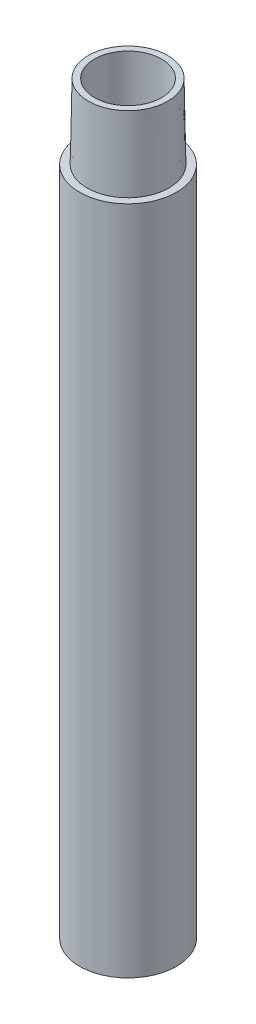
ISO-10303-21;
HEADER;
FILE_DESCRIPTION(('STEP AP214'),'2;1');
FILE_NAME('part.step','',(''),(''),'','','');
FILE_SCHEMA(('AUTOMOTIVE_DESIGN { 1 0 10303 214 1 1 1 1 }'));
ENDSEC;
DATA;
#1=APPLICATION_CONTEXT('core data for automotive mechanical design processes');
#2=APPLICATION_PROTOCOL_DEFINITION('international standard','automotive_design',2000,#1);
#3=PRODUCT_CONTEXT('',#1,'mechanical');
#4=PRODUCT('Part','Part','',(#3));
#5=PRODUCT_RELATED_PRODUCT_CATEGORY('part','',(#4));
#6=PRODUCT_DEFINITION_FORMATION('','',#4);
#7=PRODUCT_DEFINITION_CONTEXT('part definition',#1,'design');
#8=PRODUCT_DEFINITION('design','',#6,#7);
#9=PRODUCT_DEFINITION_SHAPE('','',#8);
#10=(LENGTH_UNIT() NAMED_UNIT(*) SI_UNIT(.MILLI.,.METRE.));
#11=(NAMED_UNIT(*) PLANE_ANGLE_UNIT() SI_UNIT($,.RADIAN.));
#12=(NAMED_UNIT(*) SI_UNIT($,.STERADIAN.) SOLID_ANGLE_UNIT());
#13=UNCERTAINTY_MEASURE_WITH_UNIT(LENGTH_MEASURE(1.E-05),#10,'distance_accuracy_value','');
#14=(GEOMETRIC_REPRESENTATION_CONTEXT(3) GLOBAL_UNCERTAINTY_ASSIGNED_CONTEXT((#13)) GLOBAL_UNIT_ASSIGNED_CONTEXT((#10,
#11,#12)) REPRESENTATION_CONTEXT('',''));
#15=CARTESIAN_POINT('',(0.,0.,0.));
#16=DIRECTION('',(0.,0.,1.));
#17=DIRECTION('',(1.,0.,0.));
#18=AXIS2_PLACEMENT_3D('',#15,#16,#17);
#19=CARTESIAN_POINT('',(55.,-919.506010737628,0.));
#20=DIRECTION('',(0.,-1.,0.));
#21=DIRECTION('',(0.,0.,-1.));
#22=AXIS2_PLACEMENT_3D('',#19,#20,#21);
#23=PLANE('',#22);
#24=CARTESIAN_POINT('',(0.,-919.506010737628,0.));
#25=DIRECTION('',(0.,-1.,0.));
#26=DIRECTION('',(0.,0.,-1.));
#27=AXIS2_PLACEMENT_3D('',#24,#25,#26);
#28=CIRCLE('',#27,65.);
#29=CARTESIAN_POINT('',(0.,-919.506010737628,-65.));
#30=VERTEX_POINT('',#29);
#31=EDGE_CURVE('E10',#30,#30,#28,.T.);
#32=ORIENTED_EDGE('',*,*,#31,.T.);
#33=EDGE_LOOP('',(#32));
#34=FACE_BOUND('',#33,.T.);
#35=CARTESIAN_POINT('',(0.,-919.506010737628,0.));
#36=DIRECTION('',(0.,-1.,0.));
#37=DIRECTION('',(0.,0.,-1.));
#38=AXIS2_PLACEMENT_3D('',#35,#36,#37);
#39=CIRCLE('',#38,55.);
#40=CARTESIAN_POINT('',(0.,-919.506010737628,-55.));
#41=VERTEX_POINT('',#40);
#42=EDGE_CURVE('E55',#41,#41,#39,.T.);
#43=ORIENTED_EDGE('',*,*,#42,.F.);
#44=EDGE_LOOP('',(#43));
#45=FACE_BOUND('',#44,.T.);
#46=ADVANCED_FACE('F29',(#34,#45),#23,.T.);
#47=CARTESIAN_POINT('',(0.,-969.506010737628,0.));
#48=DIRECTION('',(0.,-1.,0.));
#49=DIRECTION('',(0.,0.,-1.));
#50=AXIS2_PLACEMENT_3D('',#47,#48,#49);
#51=CYLINDRICAL_SURFACE('',#50,65.);
#52=CARTESIAN_POINT('',(0.,-19.5060107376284,0.));
#53=DIRECTION('',(0.,-1.,0.));
#54=DIRECTION('',(0.,0.,-1.));
#55=AXIS2_PLACEMENT_3D('',#52,#53,#54);
#56=CIRCLE('',#55,65.);
#57=CARTESIAN_POINT('',(0.,-19.5060107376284,-65.));
#58=VERTEX_POINT('',#57);
#59=EDGE_CURVE('E37',#58,#58,#56,.T.);
#60=ORIENTED_EDGE('',*,*,#59,.T.);
#61=EDGE_LOOP('',(#60));
#62=FACE_BOUND('',#61,.T.);
#63=ORIENTED_EDGE('',*,*,#31,.F.);
#64=EDGE_LOOP('',(#63));
#65=FACE_BOUND('',#64,.T.);
#66=ADVANCED_FACE('F63',(#62,#65),#51,.T.);
#67=CARTESIAN_POINT('',(65.,-19.5060107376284,0.));
#68=DIRECTION('',(0.,1.,0.));
#69=DIRECTION('',(0.,0.,1.));
#70=AXIS2_PLACEMENT_3D('',#67,#68,#69);
#71=PLANE('',#70);
#72=CARTESIAN_POINT('',(0.,-19.5060107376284,0.));
#73=DIRECTION('',(0.,-1.,0.));
#74=DIRECTION('',(0.,0.,-1.));
#75=AXIS2_PLACEMENT_3D('',#72,#73,#74);
#76=CIRCLE('',#75,55.);
#77=CARTESIAN_POINT('',(0.,-19.5060107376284,-55.));
#78=VERTEX_POINT('',#77);
#79=EDGE_CURVE('E41',#78,#78,#76,.T.);
#80=ORIENTED_EDGE('',*,*,#79,.T.);
#81=EDGE_LOOP('',(#80));
#82=FACE_BOUND('',#81,.T.);
#83=ORIENTED_EDGE('',*,*,#59,.F.);
#84=EDGE_LOOP('',(#83));
#85=FACE_BOUND('',#84,.T.);
#86=ADVANCED_FACE('F67',(#82,#85),#71,.T.);
#87=CARTESIAN_POINT('',(0.,-19.5060107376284,0.));
#88=DIRECTION('',(0.,-1.,0.));
#89=DIRECTION('',(0.,0.,-1.));
#90=AXIS2_PLACEMENT_3D('',#87,#88,#89);
#91=CONICAL_SURFACE('',#90,55.,0.0174532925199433);
#92=CARTESIAN_POINT('',(0.,80.4939892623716,0.));
#93=DIRECTION('',(0.,1.,0.));
#94=DIRECTION('',(0.,0.,1.));
#95=AXIS2_PLACEMENT_3D('',#92,#93,#94);
#96=CIRCLE('',#95,53.2544935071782);
#97=CARTESIAN_POINT('',(0.,80.4939892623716,53.2544935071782));
#98=VERTEX_POINT('',#97);
#99=EDGE_CURVE('E33',#98,#98,#96,.F.);
#100=ORIENTED_EDGE('',*,*,#99,.T.);
#101=EDGE_LOOP('',(#100));
#102=FACE_BOUND('',#101,.T.);
#103=ORIENTED_EDGE('',*,*,#79,.F.);
#104=EDGE_LOOP('',(#103));
#105=FACE_BOUND('',#104,.T.);
#106=ADVANCED_FACE('F31',(#102,#105),#91,.T.);
#107=CARTESIAN_POINT('',(55.,80.4939892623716,0.));
#108=DIRECTION('',(0.,1.,0.));
#109=DIRECTION('',(0.,0.,1.));
#110=AXIS2_PLACEMENT_3D('',#107,#108,#109);
#111=PLANE('',#110);
#112=CARTESIAN_POINT('',(0.,80.4939892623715,0.));
#113=DIRECTION('',(0.,-1.,0.));
#114=DIRECTION('',(0.,0.,-1.));
#115=AXIS2_PLACEMENT_3D('',#112,#113,#114);
#116=CIRCLE('',#115,45.);
#117=CARTESIAN_POINT('',(0.,80.4939892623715,-45.));
#118=VERTEX_POINT('',#117);
#119=EDGE_CURVE('E46',#118,#118,#116,.T.);
#120=ORIENTED_EDGE('',*,*,#119,.T.);
#121=EDGE_LOOP('',(#120));
#122=FACE_BOUND('',#121,.T.);
#123=ORIENTED_EDGE('',*,*,#99,.F.);
#124=EDGE_LOOP('',(#123));
#125=FACE_BOUND('',#124,.T.);
#126=ADVANCED_FACE('F74',(#122,#125),#111,.T.);
#127=CARTESIAN_POINT('',(0.,-969.506010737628,0.));
#128=DIRECTION('',(0.,-1.,0.));
#129=DIRECTION('',(0.,0.,-1.));
#130=AXIS2_PLACEMENT_3D('',#127,#128,#129);
#131=CYLINDRICAL_SURFACE('',#130,45.);
#132=CARTESIAN_POINT('',(0.,-29.5060107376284,0.));
#133=DIRECTION('',(0.,-1.,0.));
#134=DIRECTION('',(0.,0.,-1.));
#135=AXIS2_PLACEMENT_3D('',#132,#133,#134);
#136=CIRCLE('',#135,45.);
#137=CARTESIAN_POINT('',(0.,-29.5060107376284,-45.));
#138=VERTEX_POINT('',#137);
#139=EDGE_CURVE('E49',#138,#138,#136,.T.);
#140=ORIENTED_EDGE('',*,*,#139,.T.);
#141=EDGE_LOOP('',(#140));
#142=FACE_BOUND('',#141,.T.);
#143=ORIENTED_EDGE('',*,*,#119,.F.);
#144=EDGE_LOOP('',(#143));
#145=FACE_BOUND('',#144,.T.);
#146=ADVANCED_FACE('F77',(#142,#145),#131,.F.);
#147=CARTESIAN_POINT('',(55.,-29.5060107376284,0.));
#148=DIRECTION('',(0.,-1.,0.));
#149=DIRECTION('',(0.,0.,-1.));
#150=AXIS2_PLACEMENT_3D('',#147,#148,#149);
#151=PLANE('',#150);
#152=CARTESIAN_POINT('',(0.,-29.5060107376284,0.));
#153=DIRECTION('',(0.,-1.,0.));
#154=DIRECTION('',(0.,0.,-1.));
#155=AXIS2_PLACEMENT_3D('',#152,#153,#154);
#156=CIRCLE('',#155,55.);
#157=CARTESIAN_POINT('',(0.,-29.5060107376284,-55.));
#158=VERTEX_POINT('',#157);
#159=EDGE_CURVE('E52',#158,#158,#156,.T.);
#160=ORIENTED_EDGE('',*,*,#159,.T.);
#161=EDGE_LOOP('',(#160));
#162=FACE_BOUND('',#161,.T.);
#163=ORIENTED_EDGE('',*,*,#139,.F.);
#164=EDGE_LOOP('',(#163));
#165=FACE_BOUND('',#164,.T.);
#166=ADVANCED_FACE('F81',(#162,#165),#151,.T.);
#167=CARTESIAN_POINT('',(0.,-969.506010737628,0.));
#168=DIRECTION('',(0.,-1.,0.));
#169=DIRECTION('',(0.,0.,-1.));
#170=AXIS2_PLACEMENT_3D('',#167,#168,#169);
#171=CYLINDRICAL_SURFACE('',#170,55.);
#172=ORIENTED_EDGE('',*,*,#42,.T.);
#173=EDGE_LOOP('',(#172));
#174=FACE_BOUND('',#173,.T.);
#175=ORIENTED_EDGE('',*,*,#159,.F.);
#176=EDGE_LOOP('',(#175));
#177=FACE_BOUND('',#176,.T.);
#178=ADVANCED_FACE('F59',(#174,#177),#171,.F.);
#179=CLOSED_SHELL('',(#46,#66,#86,#106,#126,#146,#166,#178));
#180=MANIFOLD_SOLID_BREP('B2',#179);
#181=ADVANCED_BREP_SHAPE_REPRESENTATION('',(#18,#180),#14);
#182=SHAPE_DEFINITION_REPRESENTATION(#9,#181);
ENDSEC;
END-ISO-10303-21;
